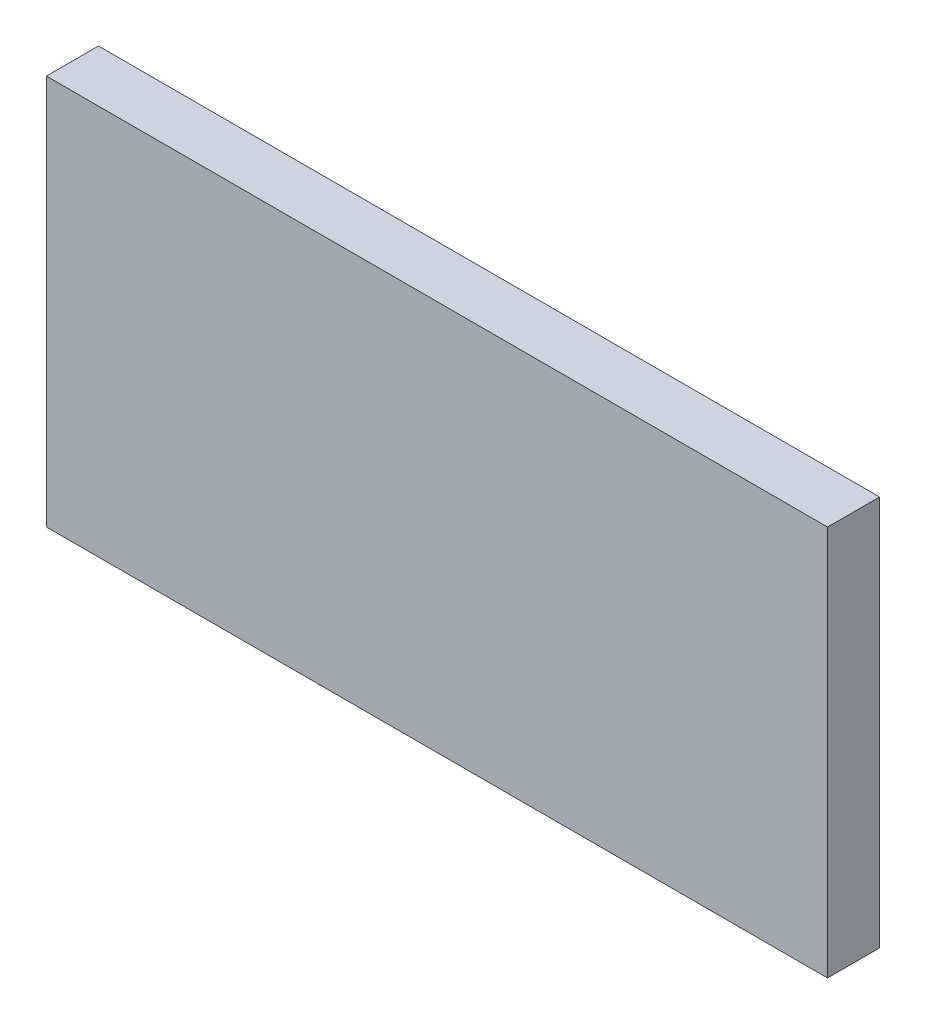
ISO-10303-21;
HEADER;
FILE_DESCRIPTION(('STEP AP214'),'2;1');
FILE_NAME('part.step','',(''),(''),'','','');
FILE_SCHEMA(('AUTOMOTIVE_DESIGN { 1 0 10303 214 1 1 1 1 }'));
ENDSEC;
DATA;
#1=APPLICATION_CONTEXT('core data for automotive mechanical design processes');
#2=APPLICATION_PROTOCOL_DEFINITION('international standard','automotive_design',2000,#1);
#3=PRODUCT_CONTEXT('',#1,'mechanical');
#4=PRODUCT('Part','Part','',(#3));
#5=PRODUCT_RELATED_PRODUCT_CATEGORY('part','',(#4));
#6=PRODUCT_DEFINITION_FORMATION('','',#4);
#7=PRODUCT_DEFINITION_CONTEXT('part definition',#1,'design');
#8=PRODUCT_DEFINITION('design','',#6,#7);
#9=PRODUCT_DEFINITION_SHAPE('','',#8);
#10=(LENGTH_UNIT() NAMED_UNIT(*) SI_UNIT(.MILLI.,.METRE.));
#11=(NAMED_UNIT(*) PLANE_ANGLE_UNIT() SI_UNIT($,.RADIAN.));
#12=(NAMED_UNIT(*) SI_UNIT($,.STERADIAN.) SOLID_ANGLE_UNIT());
#13=UNCERTAINTY_MEASURE_WITH_UNIT(LENGTH_MEASURE(1.E-05),#10,'distance_accuracy_value','');
#14=(GEOMETRIC_REPRESENTATION_CONTEXT(3) GLOBAL_UNCERTAINTY_ASSIGNED_CONTEXT((#13)) GLOBAL_UNIT_ASSIGNED_CONTEXT((#10,
#11,#12)) REPRESENTATION_CONTEXT('',''));
#15=CARTESIAN_POINT('',(0.,0.,0.));
#16=DIRECTION('',(0.,0.,1.));
#17=DIRECTION('',(1.,0.,0.));
#18=AXIS2_PLACEMENT_3D('',#15,#16,#17);
#19=CARTESIAN_POINT('',(0.,0.,20.));
#20=DIRECTION('',(0.,0.,1.));
#21=DIRECTION('',(1.,0.,0.));
#22=AXIS2_PLACEMENT_3D('',#19,#20,#21);
#23=PLANE('',#22);
#24=DIRECTION('',(1.,0.,0.));
#25=VECTOR('',#24,1.);
#26=CARTESIAN_POINT('',(-150.,-75.,20.));
#27=LINE('',#26,#25);
#28=CARTESIAN_POINT('',(-150.,-75.,20.));
#29=VERTEX_POINT('',#28);
#30=CARTESIAN_POINT('',(150.,-75.,20.));
#31=VERTEX_POINT('',#30);
#32=EDGE_CURVE('E91',#29,#31,#27,.T.);
#33=ORIENTED_EDGE('',*,*,#32,.T.);
#34=DIRECTION('',(0.,1.,0.));
#35=VECTOR('',#34,1.);
#36=CARTESIAN_POINT('',(150.,-75.,20.));
#37=LINE('',#36,#35);
#38=CARTESIAN_POINT('',(150.,75.,20.));
#39=VERTEX_POINT('',#38);
#40=EDGE_CURVE('E70',#31,#39,#37,.T.);
#41=ORIENTED_EDGE('',*,*,#40,.T.);
#42=DIRECTION('',(-1.,0.,0.));
#43=VECTOR('',#42,1.);
#44=CARTESIAN_POINT('',(150.,75.,20.));
#45=LINE('',#44,#43);
#46=CARTESIAN_POINT('',(-150.,75.,20.));
#47=VERTEX_POINT('',#46);
#48=EDGE_CURVE('E75',#39,#47,#45,.T.);
#49=ORIENTED_EDGE('',*,*,#48,.T.);
#50=DIRECTION('',(0.,-1.,0.));
#51=VECTOR('',#50,1.);
#52=CARTESIAN_POINT('',(-150.,75.,20.));
#53=LINE('',#52,#51);
#54=EDGE_CURVE('E10',#47,#29,#53,.T.);
#55=ORIENTED_EDGE('',*,*,#54,.T.);
#56=EDGE_LOOP('',(#33,#41,#49,#55));
#57=FACE_BOUND('',#56,.T.);
#58=ADVANCED_FACE('F16',(#57),#23,.T.);
#59=CARTESIAN_POINT('',(0.,0.,0.));
#60=DIRECTION('',(0.,0.,1.));
#61=DIRECTION('',(1.,0.,0.));
#62=AXIS2_PLACEMENT_3D('',#59,#60,#61);
#63=PLANE('',#62);
#64=DIRECTION('',(0.,-1.,0.));
#65=VECTOR('',#64,1.);
#66=CARTESIAN_POINT('',(-150.,75.,0.));
#67=LINE('',#66,#65);
#68=CARTESIAN_POINT('',(-150.,75.,0.));
#69=VERTEX_POINT('',#68);
#70=CARTESIAN_POINT('',(-150.,-75.,0.));
#71=VERTEX_POINT('',#70);
#72=EDGE_CURVE('E24',#69,#71,#67,.T.);
#73=ORIENTED_EDGE('',*,*,#72,.F.);
#74=DIRECTION('',(-1.,0.,0.));
#75=VECTOR('',#74,1.);
#76=CARTESIAN_POINT('',(150.,75.,0.));
#77=LINE('',#76,#75);
#78=CARTESIAN_POINT('',(150.,75.,0.));
#79=VERTEX_POINT('',#78);
#80=EDGE_CURVE('E59',#79,#69,#77,.T.);
#81=ORIENTED_EDGE('',*,*,#80,.F.);
#82=DIRECTION('',(0.,1.,0.));
#83=VECTOR('',#82,1.);
#84=CARTESIAN_POINT('',(150.,-75.,0.));
#85=LINE('',#84,#83);
#86=CARTESIAN_POINT('',(150.,-75.,0.));
#87=VERTEX_POINT('',#86);
#88=EDGE_CURVE('E64',#87,#79,#85,.T.);
#89=ORIENTED_EDGE('',*,*,#88,.F.);
#90=DIRECTION('',(1.,0.,0.));
#91=VECTOR('',#90,1.);
#92=CARTESIAN_POINT('',(-150.,-75.,0.));
#93=LINE('',#92,#91);
#94=EDGE_CURVE('E107',#71,#87,#93,.T.);
#95=ORIENTED_EDGE('',*,*,#94,.F.);
#96=EDGE_LOOP('',(#73,#81,#89,#95));
#97=FACE_BOUND('',#96,.T.);
#98=ADVANCED_FACE('F61',(#97),#63,.F.);
#99=CARTESIAN_POINT('',(-150.,75.,0.));
#100=DIRECTION('',(1.,0.,0.));
#101=DIRECTION('',(0.,1.,0.));
#102=AXIS2_PLACEMENT_3D('',#99,#100,#101);
#103=PLANE('',#102);
#104=ORIENTED_EDGE('',*,*,#72,.T.);
#105=DIRECTION('',(0.,0.,1.));
#106=VECTOR('',#105,1.);
#107=CARTESIAN_POINT('',(-150.,-75.,0.));
#108=LINE('',#107,#106);
#109=EDGE_CURVE('E86',#71,#29,#108,.T.);
#110=ORIENTED_EDGE('',*,*,#109,.T.);
#111=ORIENTED_EDGE('',*,*,#54,.F.);
#112=DIRECTION('',(0.,0.,1.));
#113=VECTOR('',#112,1.);
#114=CARTESIAN_POINT('',(-150.,75.,0.));
#115=LINE('',#114,#113);
#116=EDGE_CURVE('E69',#69,#47,#115,.T.);
#117=ORIENTED_EDGE('',*,*,#116,.F.);
#118=EDGE_LOOP('',(#104,#110,#111,#117));
#119=FACE_BOUND('',#118,.T.);
#120=ADVANCED_FACE('F126',(#119),#103,.F.);
#121=CARTESIAN_POINT('',(150.,75.,0.));
#122=DIRECTION('',(0.,-1.,0.));
#123=DIRECTION('',(0.,0.,-1.));
#124=AXIS2_PLACEMENT_3D('',#121,#122,#123);
#125=PLANE('',#124);
#126=ORIENTED_EDGE('',*,*,#80,.T.);
#127=ORIENTED_EDGE('',*,*,#116,.T.);
#128=ORIENTED_EDGE('',*,*,#48,.F.);
#129=DIRECTION('',(0.,0.,1.));
#130=VECTOR('',#129,1.);
#131=CARTESIAN_POINT('',(150.,75.,0.));
#132=LINE('',#131,#130);
#133=EDGE_CURVE('E73',#79,#39,#132,.T.);
#134=ORIENTED_EDGE('',*,*,#133,.F.);
#135=EDGE_LOOP('',(#126,#127,#128,#134));
#136=FACE_BOUND('',#135,.T.);
#137=ADVANCED_FACE('F74',(#136),#125,.F.);
#138=CARTESIAN_POINT('',(150.,-75.,0.));
#139=DIRECTION('',(-1.,0.,0.));
#140=DIRECTION('',(0.,0.,1.));
#141=AXIS2_PLACEMENT_3D('',#138,#139,#140);
#142=PLANE('',#141);
#143=ORIENTED_EDGE('',*,*,#88,.T.);
#144=ORIENTED_EDGE('',*,*,#133,.T.);
#145=ORIENTED_EDGE('',*,*,#40,.F.);
#146=DIRECTION('',(0.,0.,1.));
#147=VECTOR('',#146,1.);
#148=CARTESIAN_POINT('',(150.,-75.,0.));
#149=LINE('',#148,#147);
#150=EDGE_CURVE('E83',#87,#31,#149,.T.);
#151=ORIENTED_EDGE('',*,*,#150,.F.);
#152=EDGE_LOOP('',(#143,#144,#145,#151));
#153=FACE_BOUND('',#152,.T.);
#154=ADVANCED_FACE('F81',(#153),#142,.F.);
#155=CARTESIAN_POINT('',(-150.,-75.,0.));
#156=DIRECTION('',(0.,1.,0.));
#157=DIRECTION('',(1.,0.,0.));
#158=AXIS2_PLACEMENT_3D('',#155,#156,#157);
#159=PLANE('',#158);
#160=ORIENTED_EDGE('',*,*,#94,.T.);
#161=ORIENTED_EDGE('',*,*,#150,.T.);
#162=ORIENTED_EDGE('',*,*,#32,.F.);
#163=ORIENTED_EDGE('',*,*,#109,.F.);
#164=EDGE_LOOP('',(#160,#161,#162,#163));
#165=FACE_BOUND('',#164,.T.);
#166=ADVANCED_FACE('F114',(#165),#159,.F.);
#167=CLOSED_SHELL('',(#58,#98,#120,#137,#154,#166));
#168=MANIFOLD_SOLID_BREP('B1',#167);
#169=ADVANCED_BREP_SHAPE_REPRESENTATION('',(#18,#168),#14);
#170=SHAPE_DEFINITION_REPRESENTATION(#9,#169);
ENDSEC;
END-ISO-10303-21;
